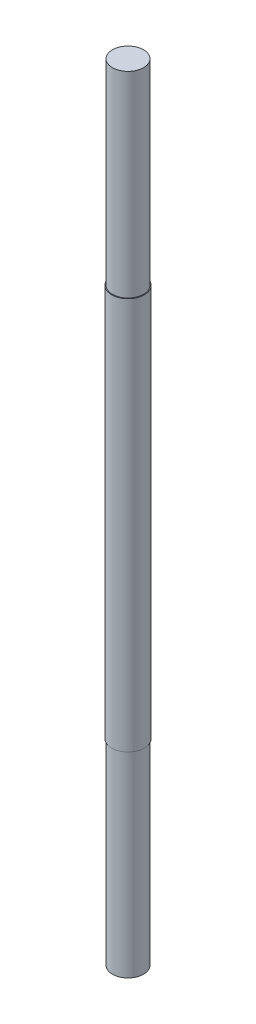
from build123d import *

# Parameters (mm, degrees)
SKETCH1_R           = 6.35
BOSS_EXTRUDE1_DEPTH = 152.4
SKETCH2_R           = 12.7
SKETCH2_R_2         = 6.0325
THREADS_A_DEPTH     = 76.2
THREADS_START       = -76.2
SKETCH3_R           = 12.7
SKETCH3_R_2         = 6.0325
THREADS_B_DEPTH     = 76.2


with BuildPart() as part:
    # Sketch1 → Boss-Extrude1 (new, symmetric)
    with BuildSketch(Plane(origin=(0, 0, 0), x_dir=(1, 0, 0), z_dir=(0, 1, 0))):
        with Locations(Location((0, 0, 0), (0, 0, 90))):
            Circle(SKETCH1_R)
    extrude(amount=BOSS_EXTRUDE1_DEPTH, both=True)

    # Sketch2 → threads a (cut)
    with BuildSketch(Plane(origin=(0, 152.4, 0), x_dir=(1, 0, 0), z_dir=(0, 1, 0))):
        Circle(SKETCH2_R)
        with Locations(Location((0, 0, 0), (0, 0, 270))):
            Circle(SKETCH2_R_2, mode=Mode.SUBTRACT)
    extrude(amount=-THREADS_A_DEPTH, mode=Mode.SUBTRACT)

    # Sketch3 → threads b (cut)
    with BuildSketch(Plane.XZ.offset(152.4).offset(THREADS_START)):
        Circle(SKETCH3_R)
        with Locations(Location((0, 0, 0), (0, 0, 90))):
            Circle(SKETCH3_R_2, mode=Mode.SUBTRACT)
    extrude(amount=THREADS_B_DEPTH, mode=Mode.SUBTRACT)


solid = part.part
